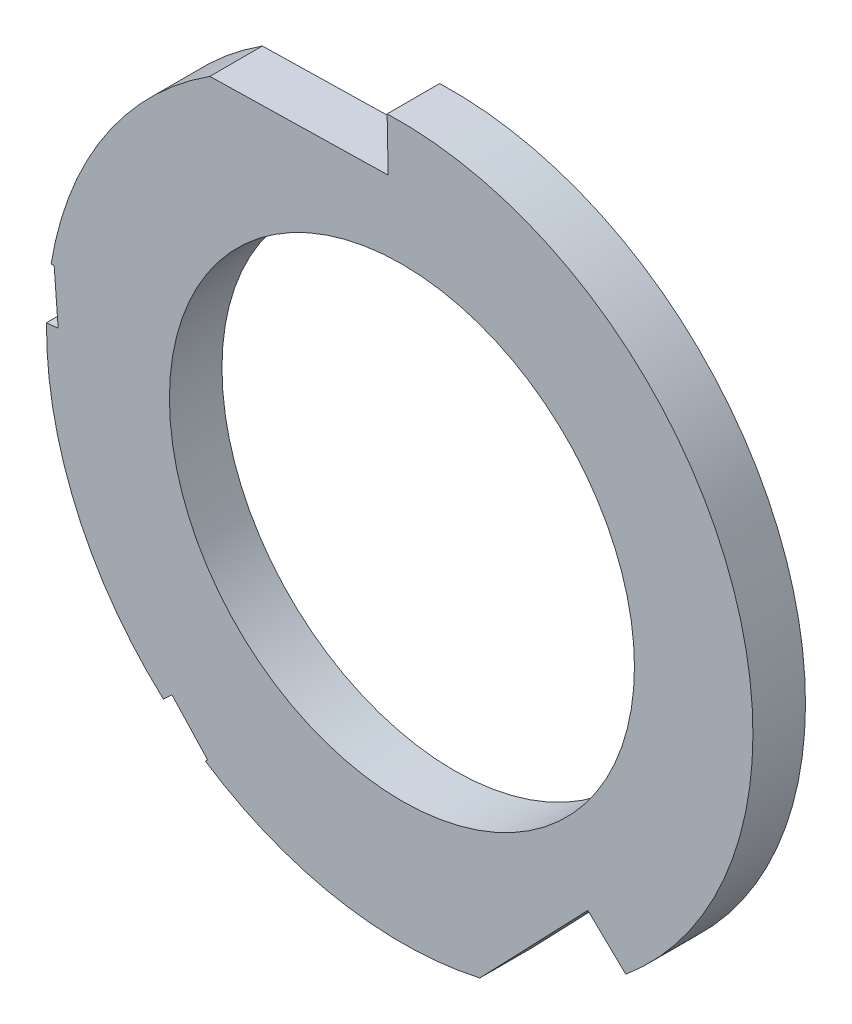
ISO-10303-21;
HEADER;
FILE_DESCRIPTION(('STEP AP214'),'2;1');
FILE_NAME('part.step','',(''),(''),'','','');
FILE_SCHEMA(('AUTOMOTIVE_DESIGN { 1 0 10303 214 1 1 1 1 }'));
ENDSEC;
DATA;
#1=APPLICATION_CONTEXT('core data for automotive mechanical design processes');
#2=APPLICATION_PROTOCOL_DEFINITION('international standard','automotive_design',2000,#1);
#3=PRODUCT_CONTEXT('',#1,'mechanical');
#4=PRODUCT('Part','Part','',(#3));
#5=PRODUCT_RELATED_PRODUCT_CATEGORY('part','',(#4));
#6=PRODUCT_DEFINITION_FORMATION('','',#4);
#7=PRODUCT_DEFINITION_CONTEXT('part definition',#1,'design');
#8=PRODUCT_DEFINITION('design','',#6,#7);
#9=PRODUCT_DEFINITION_SHAPE('','',#8);
#10=(LENGTH_UNIT() NAMED_UNIT(*) SI_UNIT(.MILLI.,.METRE.));
#11=(NAMED_UNIT(*) PLANE_ANGLE_UNIT() SI_UNIT($,.RADIAN.));
#12=(NAMED_UNIT(*) SI_UNIT($,.STERADIAN.) SOLID_ANGLE_UNIT());
#13=UNCERTAINTY_MEASURE_WITH_UNIT(LENGTH_MEASURE(1.E-05),#10,'distance_accuracy_value','');
#14=(GEOMETRIC_REPRESENTATION_CONTEXT(3) GLOBAL_UNCERTAINTY_ASSIGNED_CONTEXT((#13)) GLOBAL_UNIT_ASSIGNED_CONTEXT((#10,
#11,#12)) REPRESENTATION_CONTEXT('',''));
#15=CARTESIAN_POINT('',(0.,0.,0.));
#16=DIRECTION('',(0.,0.,1.));
#17=DIRECTION('',(1.,0.,0.));
#18=AXIS2_PLACEMENT_3D('',#15,#16,#17);
#19=CARTESIAN_POINT('',(9.46847857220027,-4.90502847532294,1.524));
#20=DIRECTION('',(0.,0.,1.));
#21=DIRECTION('',(1.,0.,0.));
#22=AXIS2_PLACEMENT_3D('',#19,#20,#21);
#23=PLANE('',#22);
#24=CARTESIAN_POINT('',(9.46847857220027,-4.90502847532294,1.524));
#25=DIRECTION('',(0.,0.,1.));
#26=DIRECTION('',(1.,0.,0.));
#27=AXIS2_PLACEMENT_3D('',#24,#25,#26);
#28=CIRCLE('',#27,10.3089848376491);
#29=CARTESIAN_POINT('',(3.89662841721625,3.76847452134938,1.524));
#30=VERTEX_POINT('',#29);
#31=CARTESIAN_POINT('',(-0.706647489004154,-3.24913656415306,1.524));
#32=VERTEX_POINT('',#31);
#33=EDGE_CURVE('E194',#30,#32,#28,.T.);
#34=ORIENTED_EDGE('',*,*,#33,.T.);
#35=DIRECTION('',(0.997022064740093,0.0771168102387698,0.));
#36=VECTOR('',#35,1.);
#37=CARTESIAN_POINT('',(-0.706647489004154,-3.24913656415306,1.524));
#38=LINE('',#37,#36);
#39=CARTESIAN_POINT('',(-0.618556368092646,-3.24232296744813,1.524));
#40=VERTEX_POINT('',#39);
#41=EDGE_CURVE('E112',#32,#40,#38,.T.);
#42=ORIENTED_EDGE('',*,*,#41,.T.);
#43=DIRECTION('',(0.0771168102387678,-0.997022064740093,0.));
#44=VECTOR('',#43,1.);
#45=CARTESIAN_POINT('',(-0.618556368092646,-3.24232296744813,1.524));
#46=LINE('',#45,#44);
#47=CARTESIAN_POINT('',(-0.501030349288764,-4.76178459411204,1.524));
#48=VERTEX_POINT('',#47);
#49=EDGE_CURVE('E227',#40,#48,#46,.T.);
#50=ORIENTED_EDGE('',*,*,#49,.T.);
#51=DIRECTION('',(-0.997022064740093,-0.0771168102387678,0.));
#52=VECTOR('',#51,1.);
#53=CARTESIAN_POINT('',(-0.501030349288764,-4.76178459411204,1.524));
#54=LINE('',#53,#52);
#55=CARTESIAN_POINT('',(-0.839841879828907,-4.78799069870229,1.524));
#56=VERTEX_POINT('',#55);
#57=EDGE_CURVE('E246',#48,#56,#54,.T.);
#58=ORIENTED_EDGE('',*,*,#57,.T.);
#59=CARTESIAN_POINT('',(9.46847857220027,-4.90502847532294,1.524));
#60=DIRECTION('',(0.,0.,1.));
#61=DIRECTION('',(1.,0.,0.));
#62=AXIS2_PLACEMENT_3D('',#59,#60,#61);
#63=CIRCLE('',#62,10.3089848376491);
#64=CARTESIAN_POINT('',(2.54962389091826,-12.5473199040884,1.524));
#65=VERTEX_POINT('',#64);
#66=EDGE_CURVE('E243',#56,#65,#63,.T.);
#67=ORIENTED_EDGE('',*,*,#66,.T.);
#68=DIRECTION('',(0.734074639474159,0.679068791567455,0.));
#69=VECTOR('',#68,1.);
#70=CARTESIAN_POINT('',(2.79907970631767,-12.3165563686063,1.524));
#71=LINE('',#70,#69);
#72=CARTESIAN_POINT('',(2.79907970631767,-12.3165563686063,1.524));
#73=VERTEX_POINT('',#72);
#74=EDGE_CURVE('E245',#65,#73,#71,.T.);
#75=ORIENTED_EDGE('',*,*,#74,.T.);
#76=DIRECTION('',(0.679068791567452,-0.734074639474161,0.));
#77=VECTOR('',#76,1.);
#78=CARTESIAN_POINT('',(3.83398054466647,-13.435286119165,1.524));
#79=LINE('',#78,#77);
#80=CARTESIAN_POINT('',(3.83398054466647,-13.435286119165,1.524));
#81=VERTEX_POINT('',#80);
#82=EDGE_CURVE('E248',#73,#81,#79,.T.);
#83=ORIENTED_EDGE('',*,*,#82,.T.);
#84=DIRECTION('',(-0.734074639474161,-0.679068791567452,0.));
#85=VECTOR('',#84,1.);
#86=CARTESIAN_POINT('',(3.76912194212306,-13.4952847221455,1.524));
#87=LINE('',#86,#85);
#88=CARTESIAN_POINT('',(3.76912194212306,-13.4952847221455,1.524));
#89=VERTEX_POINT('',#88);
#90=EDGE_CURVE('E254',#81,#89,#87,.T.);
#91=ORIENTED_EDGE('',*,*,#90,.T.);
#92=CARTESIAN_POINT('',(9.46847857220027,-4.90502847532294,1.524));
#93=DIRECTION('',(0.,0.,1.));
#94=DIRECTION('',(1.,0.,0.));
#95=AXIS2_PLACEMENT_3D('',#92,#93,#94);
#96=CIRCLE('',#95,10.3089848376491);
#97=CARTESIAN_POINT('',(11.728156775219,-14.963309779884,1.524));
#98=VERTEX_POINT('',#97);
#99=EDGE_CURVE('E256',#89,#98,#96,.T.);
#100=ORIENTED_EDGE('',*,*,#99,.T.);
#101=DIRECTION('',(0.692315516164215,0.721594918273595,0.));
#102=VECTOR('',#101,1.);
#103=CARTESIAN_POINT('',(14.8614083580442,-11.6975467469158,1.524));
#104=LINE('',#103,#102);
#105=CARTESIAN_POINT('',(14.8614083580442,-11.6975467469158,1.524));
#106=VERTEX_POINT('',#105);
#107=EDGE_CURVE('E258',#98,#106,#104,.T.);
#108=ORIENTED_EDGE('',*,*,#107,.T.);
#109=DIRECTION('',(0.721594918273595,-0.692315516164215,0.));
#110=VECTOR('',#109,1.);
#111=CARTESIAN_POINT('',(15.9611190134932,-12.75263559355,1.524));
#112=LINE('',#111,#110);
#113=CARTESIAN_POINT('',(15.9611190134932,-12.75263559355,1.524));
#114=VERTEX_POINT('',#113);
#115=EDGE_CURVE('E149',#106,#114,#112,.T.);
#116=ORIENTED_EDGE('',*,*,#115,.T.);
#117=CARTESIAN_POINT('',(9.37748878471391,-4.8685391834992,1.524));
#118=DIRECTION('',(0.,0.,1.));
#119=DIRECTION('',(-1.,0.,0.));
#120=AXIS2_PLACEMENT_3D('',#117,#118,#119);
#121=CIRCLE('',#120,10.2714732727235);
#122=CARTESIAN_POINT('',(9.03893017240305,5.39735294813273,1.524));
#123=VERTEX_POINT('',#122);
#124=EDGE_CURVE('E143',#114,#123,#121,.T.);
#125=ORIENTED_EDGE('',*,*,#124,.T.);
#126=DIRECTION('',(0.0203297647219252,-0.99979332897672,0.));
#127=VECTOR('',#126,1.);
#128=CARTESIAN_POINT('',(9.03893017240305,5.39735294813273,1.524));
#129=LINE('',#128,#127);
#130=CARTESIAN_POINT('',(9.06991273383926,3.87366791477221,1.524));
#131=VERTEX_POINT('',#130);
#132=EDGE_CURVE('E147',#123,#131,#129,.T.);
#133=ORIENTED_EDGE('',*,*,#132,.T.);
#134=DIRECTION('',(-0.99979332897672,-0.0203297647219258,0.));
#135=VECTOR('',#134,1.);
#136=CARTESIAN_POINT('',(9.06991273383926,3.87366791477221,1.524));
#137=LINE('',#136,#135);
#138=EDGE_CURVE('E51',#131,#30,#137,.T.);
#139=ORIENTED_EDGE('',*,*,#138,.T.);
#140=EDGE_LOOP('',(#34,#42,#50,#58,#67,#75,#83,#91,#100,#108,#116,#125,#133,#139));
#141=FACE_BOUND('',#140,.T.);
#142=CARTESIAN_POINT('',(9.46847857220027,-4.90502847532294,1.524));
#143=DIRECTION('',(0.,0.,1.));
#144=DIRECTION('',(1.,0.,0.));
#145=AXIS2_PLACEMENT_3D('',#142,#143,#144);
#146=CIRCLE('',#145,6.7437);
#147=CARTESIAN_POINT('',(2.72477857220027,-4.90502847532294,1.524));
#148=VERTEX_POINT('',#147);
#149=EDGE_CURVE('E171',#148,#148,#146,.T.);
#150=ORIENTED_EDGE('',*,*,#149,.F.);
#151=EDGE_LOOP('',(#150));
#152=FACE_BOUND('',#151,.T.);
#153=ADVANCED_FACE('F34',(#141,#152),#23,.T.);
#154=CARTESIAN_POINT('',(9.46847857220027,-4.90502847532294,0.));
#155=DIRECTION('',(0.,0.,1.));
#156=DIRECTION('',(1.,0.,0.));
#157=AXIS2_PLACEMENT_3D('',#154,#155,#156);
#158=PLANE('',#157);
#159=CARTESIAN_POINT('',(9.46847857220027,-4.90502847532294,0.));
#160=DIRECTION('',(0.,0.,1.));
#161=DIRECTION('',(1.,0.,0.));
#162=AXIS2_PLACEMENT_3D('',#159,#160,#161);
#163=CIRCLE('',#162,10.3089848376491);
#164=CARTESIAN_POINT('',(3.89662841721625,3.76847452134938,0.));
#165=VERTEX_POINT('',#164);
#166=CARTESIAN_POINT('',(-0.706647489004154,-3.24913656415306,0.));
#167=VERTEX_POINT('',#166);
#168=EDGE_CURVE('E167',#165,#167,#163,.T.);
#169=ORIENTED_EDGE('',*,*,#168,.F.);
#170=DIRECTION('',(-0.99979332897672,-0.0203297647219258,0.));
#171=VECTOR('',#170,1.);
#172=CARTESIAN_POINT('',(9.06991273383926,3.87366791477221,0.));
#173=LINE('',#172,#171);
#174=CARTESIAN_POINT('',(9.06991273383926,3.87366791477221,0.));
#175=VERTEX_POINT('',#174);
#176=EDGE_CURVE('E104',#175,#165,#173,.T.);
#177=ORIENTED_EDGE('',*,*,#176,.F.);
#178=DIRECTION('',(0.0203297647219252,-0.99979332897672,0.));
#179=VECTOR('',#178,1.);
#180=CARTESIAN_POINT('',(9.03893017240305,5.39735294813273,0.));
#181=LINE('',#180,#179);
#182=CARTESIAN_POINT('',(9.03893017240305,5.39735294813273,0.));
#183=VERTEX_POINT('',#182);
#184=EDGE_CURVE('E98',#183,#175,#181,.T.);
#185=ORIENTED_EDGE('',*,*,#184,.F.);
#186=CARTESIAN_POINT('',(9.37748878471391,-4.8685391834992,0.));
#187=DIRECTION('',(0.,0.,1.));
#188=DIRECTION('',(-1.,0.,0.));
#189=AXIS2_PLACEMENT_3D('',#186,#187,#188);
#190=CIRCLE('',#189,10.2714732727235);
#191=CARTESIAN_POINT('',(15.9611190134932,-12.75263559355,0.));
#192=VERTEX_POINT('',#191);
#193=EDGE_CURVE('E157',#192,#183,#190,.T.);
#194=ORIENTED_EDGE('',*,*,#193,.F.);
#195=DIRECTION('',(0.721594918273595,-0.692315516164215,0.));
#196=VECTOR('',#195,1.);
#197=CARTESIAN_POINT('',(15.9611190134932,-12.75263559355,0.));
#198=LINE('',#197,#196);
#199=CARTESIAN_POINT('',(14.8614083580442,-11.6975467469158,0.));
#200=VERTEX_POINT('',#199);
#201=EDGE_CURVE('E189',#200,#192,#198,.T.);
#202=ORIENTED_EDGE('',*,*,#201,.F.);
#203=DIRECTION('',(0.692315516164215,0.721594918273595,0.));
#204=VECTOR('',#203,1.);
#205=CARTESIAN_POINT('',(14.8614083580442,-11.6975467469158,0.));
#206=LINE('',#205,#204);
#207=CARTESIAN_POINT('',(11.728156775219,-14.963309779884,0.));
#208=VERTEX_POINT('',#207);
#209=EDGE_CURVE('E187',#208,#200,#206,.T.);
#210=ORIENTED_EDGE('',*,*,#209,.F.);
#211=CARTESIAN_POINT('',(9.46847857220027,-4.90502847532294,0.));
#212=DIRECTION('',(0.,0.,1.));
#213=DIRECTION('',(1.,0.,0.));
#214=AXIS2_PLACEMENT_3D('',#211,#212,#213);
#215=CIRCLE('',#214,10.3089848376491);
#216=CARTESIAN_POINT('',(3.76912194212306,-13.4952847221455,0.));
#217=VERTEX_POINT('',#216);
#218=EDGE_CURVE('E185',#217,#208,#215,.T.);
#219=ORIENTED_EDGE('',*,*,#218,.F.);
#220=DIRECTION('',(-0.734074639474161,-0.679068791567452,0.));
#221=VECTOR('',#220,1.);
#222=CARTESIAN_POINT('',(3.76912194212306,-13.4952847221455,0.));
#223=LINE('',#222,#221);
#224=CARTESIAN_POINT('',(3.83398054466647,-13.435286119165,0.));
#225=VERTEX_POINT('',#224);
#226=EDGE_CURVE('E183',#225,#217,#223,.T.);
#227=ORIENTED_EDGE('',*,*,#226,.F.);
#228=DIRECTION('',(0.679068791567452,-0.734074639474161,0.));
#229=VECTOR('',#228,1.);
#230=CARTESIAN_POINT('',(3.83398054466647,-13.435286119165,0.));
#231=LINE('',#230,#229);
#232=CARTESIAN_POINT('',(2.79907970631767,-12.3165563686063,0.));
#233=VERTEX_POINT('',#232);
#234=EDGE_CURVE('E181',#233,#225,#231,.T.);
#235=ORIENTED_EDGE('',*,*,#234,.F.);
#236=DIRECTION('',(0.734074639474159,0.679068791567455,0.));
#237=VECTOR('',#236,1.);
#238=CARTESIAN_POINT('',(2.79907970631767,-12.3165563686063,0.));
#239=LINE('',#238,#237);
#240=CARTESIAN_POINT('',(2.54962389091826,-12.5473199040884,0.));
#241=VERTEX_POINT('',#240);
#242=EDGE_CURVE('E179',#241,#233,#239,.T.);
#243=ORIENTED_EDGE('',*,*,#242,.F.);
#244=CARTESIAN_POINT('',(9.46847857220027,-4.90502847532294,0.));
#245=DIRECTION('',(0.,0.,1.));
#246=DIRECTION('',(1.,0.,0.));
#247=AXIS2_PLACEMENT_3D('',#244,#245,#246);
#248=CIRCLE('',#247,10.3089848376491);
#249=CARTESIAN_POINT('',(-0.839841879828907,-4.78799069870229,0.));
#250=VERTEX_POINT('',#249);
#251=EDGE_CURVE('E177',#250,#241,#248,.T.);
#252=ORIENTED_EDGE('',*,*,#251,.F.);
#253=DIRECTION('',(-0.997022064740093,-0.0771168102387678,0.));
#254=VECTOR('',#253,1.);
#255=CARTESIAN_POINT('',(-0.501030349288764,-4.76178459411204,0.));
#256=LINE('',#255,#254);
#257=CARTESIAN_POINT('',(-0.501030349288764,-4.76178459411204,0.));
#258=VERTEX_POINT('',#257);
#259=EDGE_CURVE('E175',#258,#250,#256,.T.);
#260=ORIENTED_EDGE('',*,*,#259,.F.);
#261=DIRECTION('',(0.0771168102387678,-0.997022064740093,0.));
#262=VECTOR('',#261,1.);
#263=CARTESIAN_POINT('',(-0.618556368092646,-3.24232296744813,0.));
#264=LINE('',#263,#262);
#265=CARTESIAN_POINT('',(-0.618556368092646,-3.24232296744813,0.));
#266=VERTEX_POINT('',#265);
#267=EDGE_CURVE('E173',#266,#258,#264,.T.);
#268=ORIENTED_EDGE('',*,*,#267,.F.);
#269=DIRECTION('',(0.997022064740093,0.0771168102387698,0.));
#270=VECTOR('',#269,1.);
#271=CARTESIAN_POINT('',(-0.706647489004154,-3.24913656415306,0.));
#272=LINE('',#271,#270);
#273=EDGE_CURVE('E170',#167,#266,#272,.T.);
#274=ORIENTED_EDGE('',*,*,#273,.F.);
#275=EDGE_LOOP('',(#169,#177,#185,#194,#202,#210,#219,#227,#235,#243,#252,#260,#268,#274));
#276=FACE_BOUND('',#275,.T.);
#277=CARTESIAN_POINT('',(9.46847857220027,-4.90502847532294,0.));
#278=DIRECTION('',(0.,0.,1.));
#279=DIRECTION('',(1.,0.,0.));
#280=AXIS2_PLACEMENT_3D('',#277,#278,#279);
#281=CIRCLE('',#280,6.7437);
#282=CARTESIAN_POINT('',(2.72477857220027,-4.90502847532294,0.));
#283=VERTEX_POINT('',#282);
#284=EDGE_CURVE('E431',#283,#283,#281,.T.);
#285=ORIENTED_EDGE('',*,*,#284,.T.);
#286=EDGE_LOOP('',(#285));
#287=FACE_BOUND('',#286,.T.);
#288=ADVANCED_FACE('F231',(#276,#287),#158,.F.);
#289=CARTESIAN_POINT('',(9.46847857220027,-4.90502847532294,1.524));
#290=DIRECTION('',(0.,0.,-1.));
#291=DIRECTION('',(-1.,0.,0.));
#292=AXIS2_PLACEMENT_3D('',#289,#290,#291);
#293=CYLINDRICAL_SURFACE('',#292,10.3089848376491);
#294=ORIENTED_EDGE('',*,*,#168,.T.);
#295=DIRECTION('',(0.,0.,-1.));
#296=VECTOR('',#295,1.);
#297=CARTESIAN_POINT('',(-0.706647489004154,-3.24913656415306,1.524));
#298=LINE('',#297,#296);
#299=EDGE_CURVE('E11',#32,#167,#298,.T.);
#300=ORIENTED_EDGE('',*,*,#299,.F.);
#301=ORIENTED_EDGE('',*,*,#33,.F.);
#302=DIRECTION('',(0.,0.,-1.));
#303=VECTOR('',#302,1.);
#304=CARTESIAN_POINT('',(3.89662841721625,3.76847452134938,1.524));
#305=LINE('',#304,#303);
#306=EDGE_CURVE('E163',#30,#165,#305,.T.);
#307=ORIENTED_EDGE('',*,*,#306,.T.);
#308=EDGE_LOOP('',(#294,#300,#301,#307));
#309=FACE_BOUND('',#308,.T.);
#310=ADVANCED_FACE('F36',(#309),#293,.T.);
#311=CARTESIAN_POINT('',(-0.706647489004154,-3.24913656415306,1.524));
#312=DIRECTION('',(-0.0771168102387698,0.997022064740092,0.));
#313=DIRECTION('',(-0.997022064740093,-0.0771168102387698,0.));
#314=AXIS2_PLACEMENT_3D('',#311,#312,#313);
#315=PLANE('',#314);
#316=ORIENTED_EDGE('',*,*,#273,.T.);
#317=DIRECTION('',(0.,0.,-1.));
#318=VECTOR('',#317,1.);
#319=CARTESIAN_POINT('',(-0.618556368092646,-3.24232296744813,1.524));
#320=LINE('',#319,#318);
#321=EDGE_CURVE('E43',#40,#266,#320,.T.);
#322=ORIENTED_EDGE('',*,*,#321,.F.);
#323=ORIENTED_EDGE('',*,*,#41,.F.);
#324=ORIENTED_EDGE('',*,*,#299,.T.);
#325=EDGE_LOOP('',(#316,#322,#323,#324));
#326=FACE_BOUND('',#325,.T.);
#327=ADVANCED_FACE('F292',(#326),#315,.F.);
#328=CARTESIAN_POINT('',(-0.618556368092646,-3.24232296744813,1.524));
#329=DIRECTION('',(0.997022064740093,0.0771168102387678,0.));
#330=DIRECTION('',(-0.0771168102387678,0.997022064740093,0.));
#331=AXIS2_PLACEMENT_3D('',#328,#329,#330);
#332=PLANE('',#331);
#333=ORIENTED_EDGE('',*,*,#267,.T.);
#334=DIRECTION('',(0.,0.,-1.));
#335=VECTOR('',#334,1.);
#336=CARTESIAN_POINT('',(-0.501030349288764,-4.76178459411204,1.524));
#337=LINE('',#336,#335);
#338=EDGE_CURVE('E219',#48,#258,#337,.T.);
#339=ORIENTED_EDGE('',*,*,#338,.F.);
#340=ORIENTED_EDGE('',*,*,#49,.F.);
#341=ORIENTED_EDGE('',*,*,#321,.T.);
#342=EDGE_LOOP('',(#333,#339,#340,#341));
#343=FACE_BOUND('',#342,.T.);
#344=ADVANCED_FACE('F225',(#343),#332,.F.);
#345=CARTESIAN_POINT('',(-0.501030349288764,-4.76178459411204,1.524));
#346=DIRECTION('',(0.0771168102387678,-0.997022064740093,0.));
#347=DIRECTION('',(0.997022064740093,0.0771168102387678,0.));
#348=AXIS2_PLACEMENT_3D('',#345,#346,#347);
#349=PLANE('',#348);
#350=ORIENTED_EDGE('',*,*,#259,.T.);
#351=DIRECTION('',(0.,0.,-1.));
#352=VECTOR('',#351,1.);
#353=CARTESIAN_POINT('',(-0.839841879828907,-4.78799069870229,1.524));
#354=LINE('',#353,#352);
#355=EDGE_CURVE('E216',#56,#250,#354,.T.);
#356=ORIENTED_EDGE('',*,*,#355,.F.);
#357=ORIENTED_EDGE('',*,*,#57,.F.);
#358=ORIENTED_EDGE('',*,*,#338,.T.);
#359=EDGE_LOOP('',(#350,#356,#357,#358));
#360=FACE_BOUND('',#359,.T.);
#361=ADVANCED_FACE('F237',(#360),#349,.F.);
#362=CARTESIAN_POINT('',(9.46847857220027,-4.90502847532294,1.524));
#363=DIRECTION('',(0.,0.,-1.));
#364=DIRECTION('',(-1.,0.,0.));
#365=AXIS2_PLACEMENT_3D('',#362,#363,#364);
#366=CYLINDRICAL_SURFACE('',#365,10.3089848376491);
#367=ORIENTED_EDGE('',*,*,#251,.T.);
#368=DIRECTION('',(0.,0.,-1.));
#369=VECTOR('',#368,1.);
#370=CARTESIAN_POINT('',(2.54962389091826,-12.5473199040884,1.524));
#371=LINE('',#370,#369);
#372=EDGE_CURVE('E213',#65,#241,#371,.T.);
#373=ORIENTED_EDGE('',*,*,#372,.F.);
#374=ORIENTED_EDGE('',*,*,#66,.F.);
#375=ORIENTED_EDGE('',*,*,#355,.T.);
#376=EDGE_LOOP('',(#367,#373,#374,#375));
#377=FACE_BOUND('',#376,.T.);
#378=ADVANCED_FACE('F241',(#377),#366,.T.);
#379=CARTESIAN_POINT('',(2.79907970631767,-12.3165563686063,1.524));
#380=DIRECTION('',(-0.679068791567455,0.734074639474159,0.));
#381=DIRECTION('',(-0.734074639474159,-0.679068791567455,0.));
#382=AXIS2_PLACEMENT_3D('',#379,#380,#381);
#383=PLANE('',#382);
#384=ORIENTED_EDGE('',*,*,#242,.T.);
#385=DIRECTION('',(0.,0.,-1.));
#386=VECTOR('',#385,1.);
#387=CARTESIAN_POINT('',(2.79907970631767,-12.3165563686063,1.524));
#388=LINE('',#387,#386);
#389=EDGE_CURVE('E210',#73,#233,#388,.T.);
#390=ORIENTED_EDGE('',*,*,#389,.F.);
#391=ORIENTED_EDGE('',*,*,#74,.F.);
#392=ORIENTED_EDGE('',*,*,#372,.T.);
#393=EDGE_LOOP('',(#384,#390,#391,#392));
#394=FACE_BOUND('',#393,.T.);
#395=ADVANCED_FACE('F305',(#394),#383,.F.);
#396=CARTESIAN_POINT('',(3.83398054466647,-13.435286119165,1.524));
#397=DIRECTION('',(0.734074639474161,0.679068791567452,0.));
#398=DIRECTION('',(-0.679068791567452,0.734074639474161,0.));
#399=AXIS2_PLACEMENT_3D('',#396,#397,#398);
#400=PLANE('',#399);
#401=ORIENTED_EDGE('',*,*,#234,.T.);
#402=DIRECTION('',(0.,0.,-1.));
#403=VECTOR('',#402,1.);
#404=CARTESIAN_POINT('',(3.83398054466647,-13.435286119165,1.524));
#405=LINE('',#404,#403);
#406=EDGE_CURVE('E207',#81,#225,#405,.T.);
#407=ORIENTED_EDGE('',*,*,#406,.F.);
#408=ORIENTED_EDGE('',*,*,#82,.F.);
#409=ORIENTED_EDGE('',*,*,#389,.T.);
#410=EDGE_LOOP('',(#401,#407,#408,#409));
#411=FACE_BOUND('',#410,.T.);
#412=ADVANCED_FACE('F308',(#411),#400,.F.);
#413=CARTESIAN_POINT('',(3.76912194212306,-13.4952847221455,1.524));
#414=DIRECTION('',(0.679068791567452,-0.734074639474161,0.));
#415=DIRECTION('',(0.734074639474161,0.679068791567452,0.));
#416=AXIS2_PLACEMENT_3D('',#413,#414,#415);
#417=PLANE('',#416);
#418=ORIENTED_EDGE('',*,*,#226,.T.);
#419=DIRECTION('',(0.,0.,-1.));
#420=VECTOR('',#419,1.);
#421=CARTESIAN_POINT('',(3.76912194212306,-13.4952847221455,1.524));
#422=LINE('',#421,#420);
#423=EDGE_CURVE('E204',#89,#217,#422,.T.);
#424=ORIENTED_EDGE('',*,*,#423,.F.);
#425=ORIENTED_EDGE('',*,*,#90,.F.);
#426=ORIENTED_EDGE('',*,*,#406,.T.);
#427=EDGE_LOOP('',(#418,#424,#425,#426));
#428=FACE_BOUND('',#427,.T.);
#429=ADVANCED_FACE('F312',(#428),#417,.F.);
#430=CARTESIAN_POINT('',(9.46847857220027,-4.90502847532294,1.524));
#431=DIRECTION('',(0.,0.,-1.));
#432=DIRECTION('',(-1.,0.,0.));
#433=AXIS2_PLACEMENT_3D('',#430,#431,#432);
#434=CYLINDRICAL_SURFACE('',#433,10.3089848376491);
#435=ORIENTED_EDGE('',*,*,#218,.T.);
#436=DIRECTION('',(0.,0.,-1.));
#437=VECTOR('',#436,1.);
#438=CARTESIAN_POINT('',(11.728156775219,-14.963309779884,1.524));
#439=LINE('',#438,#437);
#440=EDGE_CURVE('E201',#98,#208,#439,.T.);
#441=ORIENTED_EDGE('',*,*,#440,.F.);
#442=ORIENTED_EDGE('',*,*,#99,.F.);
#443=ORIENTED_EDGE('',*,*,#423,.T.);
#444=EDGE_LOOP('',(#435,#441,#442,#443));
#445=FACE_BOUND('',#444,.T.);
#446=ADVANCED_FACE('F316',(#445),#434,.T.);
#447=CARTESIAN_POINT('',(14.8614083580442,-11.6975467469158,1.524));
#448=DIRECTION('',(-0.721594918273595,0.692315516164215,0.));
#449=DIRECTION('',(-0.692315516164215,-0.721594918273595,0.));
#450=AXIS2_PLACEMENT_3D('',#447,#448,#449);
#451=PLANE('',#450);
#452=ORIENTED_EDGE('',*,*,#209,.T.);
#453=DIRECTION('',(0.,0.,-1.));
#454=VECTOR('',#453,1.);
#455=CARTESIAN_POINT('',(14.8614083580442,-11.6975467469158,1.524));
#456=LINE('',#455,#454);
#457=EDGE_CURVE('E198',#106,#200,#456,.T.);
#458=ORIENTED_EDGE('',*,*,#457,.F.);
#459=ORIENTED_EDGE('',*,*,#107,.F.);
#460=ORIENTED_EDGE('',*,*,#440,.T.);
#461=EDGE_LOOP('',(#452,#458,#459,#460));
#462=FACE_BOUND('',#461,.T.);
#463=ADVANCED_FACE('F264',(#462),#451,.F.);
#464=CARTESIAN_POINT('',(15.9611190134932,-12.75263559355,1.524));
#465=DIRECTION('',(0.692315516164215,0.721594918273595,0.));
#466=DIRECTION('',(-0.721594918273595,0.692315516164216,0.));
#467=AXIS2_PLACEMENT_3D('',#464,#465,#466);
#468=PLANE('',#467);
#469=ORIENTED_EDGE('',*,*,#201,.T.);
#470=DIRECTION('',(0.,0.,-1.));
#471=VECTOR('',#470,1.);
#472=CARTESIAN_POINT('',(15.9611190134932,-12.75263559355,1.524));
#473=LINE('',#472,#471);
#474=EDGE_CURVE('E158',#114,#192,#473,.T.);
#475=ORIENTED_EDGE('',*,*,#474,.F.);
#476=ORIENTED_EDGE('',*,*,#115,.F.);
#477=ORIENTED_EDGE('',*,*,#457,.T.);
#478=EDGE_LOOP('',(#469,#475,#476,#477));
#479=FACE_BOUND('',#478,.T.);
#480=ADVANCED_FACE('F268',(#479),#468,.F.);
#481=CARTESIAN_POINT('',(9.37748878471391,-4.8685391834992,1.524));
#482=DIRECTION('',(0.,0.,-1.));
#483=DIRECTION('',(-1.,0.,0.));
#484=AXIS2_PLACEMENT_3D('',#481,#482,#483);
#485=CYLINDRICAL_SURFACE('',#484,10.2714732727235);
#486=ORIENTED_EDGE('',*,*,#193,.T.);
#487=DIRECTION('',(0.,0.,-1.));
#488=VECTOR('',#487,1.);
#489=CARTESIAN_POINT('',(9.03893017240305,5.39735294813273,1.524));
#490=LINE('',#489,#488);
#491=EDGE_CURVE('E154',#123,#183,#490,.T.);
#492=ORIENTED_EDGE('',*,*,#491,.F.);
#493=ORIENTED_EDGE('',*,*,#124,.F.);
#494=ORIENTED_EDGE('',*,*,#474,.T.);
#495=EDGE_LOOP('',(#486,#492,#493,#494));
#496=FACE_BOUND('',#495,.T.);
#497=ADVANCED_FACE('F155',(#496),#485,.T.);
#498=CARTESIAN_POINT('',(9.03893017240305,5.39735294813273,1.524));
#499=DIRECTION('',(0.999793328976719,0.0203297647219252,0.));
#500=DIRECTION('',(-0.0203297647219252,0.99979332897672,0.));
#501=AXIS2_PLACEMENT_3D('',#498,#499,#500);
#502=PLANE('',#501);
#503=ORIENTED_EDGE('',*,*,#184,.T.);
#504=DIRECTION('',(0.,0.,-1.));
#505=VECTOR('',#504,1.);
#506=CARTESIAN_POINT('',(9.06991273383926,3.87366791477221,1.524));
#507=LINE('',#506,#505);
#508=EDGE_CURVE('E159',#131,#175,#507,.T.);
#509=ORIENTED_EDGE('',*,*,#508,.F.);
#510=ORIENTED_EDGE('',*,*,#132,.F.);
#511=ORIENTED_EDGE('',*,*,#491,.T.);
#512=EDGE_LOOP('',(#503,#509,#510,#511));
#513=FACE_BOUND('',#512,.T.);
#514=ADVANCED_FACE('F161',(#513),#502,.F.);
#515=CARTESIAN_POINT('',(9.06991273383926,3.87366791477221,1.524));
#516=DIRECTION('',(0.0203297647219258,-0.99979332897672,0.));
#517=DIRECTION('',(0.99979332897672,0.0203297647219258,0.));
#518=AXIS2_PLACEMENT_3D('',#515,#516,#517);
#519=PLANE('',#518);
#520=ORIENTED_EDGE('',*,*,#176,.T.);
#521=ORIENTED_EDGE('',*,*,#306,.F.);
#522=ORIENTED_EDGE('',*,*,#138,.F.);
#523=ORIENTED_EDGE('',*,*,#508,.T.);
#524=EDGE_LOOP('',(#520,#521,#522,#523));
#525=FACE_BOUND('',#524,.T.);
#526=ADVANCED_FACE('F272',(#525),#519,.F.);
#527=CARTESIAN_POINT('',(9.46847857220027,-4.90502847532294,1.524));
#528=DIRECTION('',(0.,0.,-1.));
#529=DIRECTION('',(-1.,0.,0.));
#530=AXIS2_PLACEMENT_3D('',#527,#528,#529);
#531=CYLINDRICAL_SURFACE('',#530,6.7437);
#532=CARTESIAN_POINT('',(2.72477857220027,-4.90502847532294,1.524));
#533=CARTESIAN_POINT('',(2.72477857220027,-4.90502847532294,1.508125));
#534=CARTESIAN_POINT('',(2.72477857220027,-4.90502847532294,1.49225));
#535=CARTESIAN_POINT('',(2.72477857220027,-4.90502847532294,1.4605));
#536=CARTESIAN_POINT('',(2.72477857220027,-4.90502847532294,1.444625));
#537=CARTESIAN_POINT('',(2.72477857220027,-4.90502847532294,1.412875));
#538=CARTESIAN_POINT('',(2.72477857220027,-4.90502847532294,1.397));
#539=CARTESIAN_POINT('',(2.72477857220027,-4.90502847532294,1.36525));
#540=CARTESIAN_POINT('',(2.72477857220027,-4.90502847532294,1.349375));
#541=CARTESIAN_POINT('',(2.72477857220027,-4.90502847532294,1.317625));
#542=CARTESIAN_POINT('',(2.72477857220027,-4.90502847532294,1.30175));
#543=CARTESIAN_POINT('',(2.72477857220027,-4.90502847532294,1.27));
#544=CARTESIAN_POINT('',(2.72477857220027,-4.90502847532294,1.254125));
#545=CARTESIAN_POINT('',(2.72477857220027,-4.90502847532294,1.222375));
#546=CARTESIAN_POINT('',(2.72477857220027,-4.90502847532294,1.2065));
#547=CARTESIAN_POINT('',(2.72477857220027,-4.90502847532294,1.17475));
#548=CARTESIAN_POINT('',(2.72477857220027,-4.90502847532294,1.158875));
#549=CARTESIAN_POINT('',(2.72477857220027,-4.90502847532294,1.127125));
#550=CARTESIAN_POINT('',(2.72477857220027,-4.90502847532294,1.11125));
#551=CARTESIAN_POINT('',(2.72477857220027,-4.90502847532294,1.0795));
#552=CARTESIAN_POINT('',(2.72477857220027,-4.90502847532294,1.063625));
#553=CARTESIAN_POINT('',(2.72477857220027,-4.90502847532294,1.031875));
#554=CARTESIAN_POINT('',(2.72477857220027,-4.90502847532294,1.016));
#555=CARTESIAN_POINT('',(2.72477857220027,-4.90502847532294,0.98425));
#556=CARTESIAN_POINT('',(2.72477857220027,-4.90502847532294,0.968375));
#557=CARTESIAN_POINT('',(2.72477857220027,-4.90502847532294,0.936625));
#558=CARTESIAN_POINT('',(2.72477857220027,-4.90502847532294,0.92075));
#559=CARTESIAN_POINT('',(2.72477857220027,-4.90502847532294,0.889));
#560=CARTESIAN_POINT('',(2.72477857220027,-4.90502847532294,0.873125));
#561=CARTESIAN_POINT('',(2.72477857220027,-4.90502847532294,0.841375));
#562=CARTESIAN_POINT('',(2.72477857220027,-4.90502847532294,0.8255));
#563=CARTESIAN_POINT('',(2.72477857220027,-4.90502847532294,0.79375));
#564=CARTESIAN_POINT('',(2.72477857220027,-4.90502847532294,0.777875));
#565=CARTESIAN_POINT('',(2.72477857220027,-4.90502847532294,0.746125));
#566=CARTESIAN_POINT('',(2.72477857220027,-4.90502847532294,0.73025));
#567=CARTESIAN_POINT('',(2.72477857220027,-4.90502847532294,0.6985));
#568=CARTESIAN_POINT('',(2.72477857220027,-4.90502847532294,0.682625));
#569=CARTESIAN_POINT('',(2.72477857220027,-4.90502847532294,0.650875));
#570=CARTESIAN_POINT('',(2.72477857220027,-4.90502847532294,0.635));
#571=CARTESIAN_POINT('',(2.72477857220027,-4.90502847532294,0.60325));
#572=CARTESIAN_POINT('',(2.72477857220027,-4.90502847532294,0.587375));
#573=CARTESIAN_POINT('',(2.72477857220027,-4.90502847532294,0.555625));
#574=CARTESIAN_POINT('',(2.72477857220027,-4.90502847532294,0.53975));
#575=CARTESIAN_POINT('',(2.72477857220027,-4.90502847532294,0.508));
#576=CARTESIAN_POINT('',(2.72477857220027,-4.90502847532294,0.492125));
#577=CARTESIAN_POINT('',(2.72477857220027,-4.90502847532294,0.460375));
#578=CARTESIAN_POINT('',(2.72477857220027,-4.90502847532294,0.4445));
#579=CARTESIAN_POINT('',(2.72477857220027,-4.90502847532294,0.41275));
#580=CARTESIAN_POINT('',(2.72477857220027,-4.90502847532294,0.396875));
#581=CARTESIAN_POINT('',(2.72477857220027,-4.90502847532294,0.365125));
#582=CARTESIAN_POINT('',(2.72477857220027,-4.90502847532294,0.34925));
#583=CARTESIAN_POINT('',(2.72477857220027,-4.90502847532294,0.3175));
#584=CARTESIAN_POINT('',(2.72477857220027,-4.90502847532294,0.301625));
#585=CARTESIAN_POINT('',(2.72477857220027,-4.90502847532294,0.269875));
#586=CARTESIAN_POINT('',(2.72477857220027,-4.90502847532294,0.254));
#587=CARTESIAN_POINT('',(2.72477857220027,-4.90502847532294,0.22225));
#588=CARTESIAN_POINT('',(2.72477857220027,-4.90502847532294,0.206375));
#589=CARTESIAN_POINT('',(2.72477857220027,-4.90502847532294,0.174625));
#590=CARTESIAN_POINT('',(2.72477857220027,-4.90502847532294,0.15875));
#591=CARTESIAN_POINT('',(2.72477857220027,-4.90502847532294,0.127));
#592=CARTESIAN_POINT('',(2.72477857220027,-4.90502847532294,0.111125));
#593=CARTESIAN_POINT('',(2.72477857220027,-4.90502847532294,0.079375));
#594=CARTESIAN_POINT('',(2.72477857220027,-4.90502847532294,0.0635));
#595=CARTESIAN_POINT('',(2.72477857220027,-4.90502847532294,0.0317499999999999));
#596=CARTESIAN_POINT('',(2.72477857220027,-4.90502847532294,0.015875));
#597=CARTESIAN_POINT('',(2.72477857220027,-4.90502847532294,0.));
#598=B_SPLINE_CURVE_WITH_KNOTS('',3,(#532,#533,#534,#535,#536,#537,#538,#539,#540,#541,#542,
#543,#544,#545,#546,#547,#548,#549,#550,#551,#552,#553,#554,#555,#556,#557,#558,#559,#560,#561,
#562,#563,#564,#565,#566,#567,#568,#569,#570,#571,#572,#573,#574,#575,#576,#577,#578,#579,#580,
#581,#582,#583,#584,#585,#586,#587,#588,#589,#590,#591,#592,#593,#594,#595,#596,#597),
.UNSPECIFIED.,.F.,.F.,(4,2,2,2,2,2,2,2,2,2,2,2,2,2,2,2,2,2,2,2,2,2,2,2,2,2,2,2,2,2,2,2,4),(0.,
0.0476249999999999,0.0952499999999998,0.142875,0.1905,0.238125,0.28575,0.333375,0.381,0.428625,
0.47625,0.523875,0.5715,0.619125,0.66675,0.714375,0.762,0.809625,0.85725,0.904875,0.9525,
1.000125,1.04775,1.095375,1.143,1.190625,1.23825,1.285875,1.3335,1.381125,1.42875,1.476375,
1.524),.UNSPECIFIED.);
#599=EDGE_CURVE('BSEAM274',#148,#283,#598,.T.);
#600=ORIENTED_EDGE('',*,*,#149,.T.);
#601=ORIENTED_EDGE('',*,*,#284,.F.);
#602=ORIENTED_EDGE('',*,*,#599,.T.);
#603=ORIENTED_EDGE('',*,*,#599,.F.);
#604=EDGE_LOOP('',(#600,#602,#601,#603));
#605=FACE_BOUND('',#604,.T.);
#606=ADVANCED_FACE('F274',(#605),#531,.F.);
#607=CLOSED_SHELL('',(#153,#288,#310,#327,#344,#361,#378,#395,#412,#429,#446,#463,#480,#497,
#514,#526,#606));
#608=MANIFOLD_SOLID_BREP('B2',#607);
#609=ADVANCED_BREP_SHAPE_REPRESENTATION('',(#18,#608),#14);
#610=SHAPE_DEFINITION_REPRESENTATION(#9,#609);
ENDSEC;
END-ISO-10303-21;
